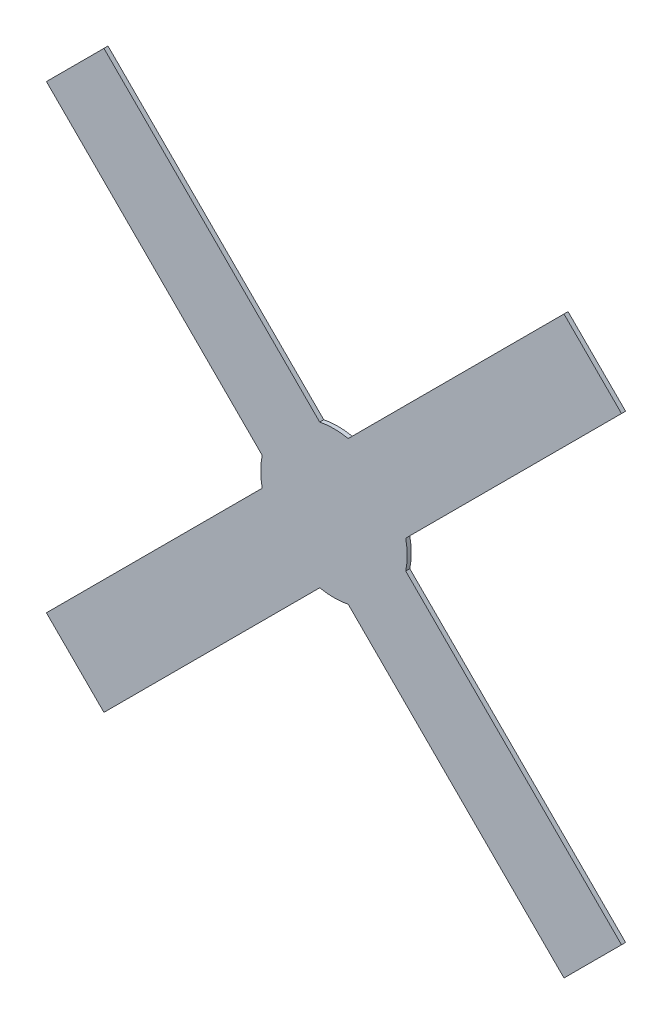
ISO-10303-21;
HEADER;
FILE_DESCRIPTION(('STEP AP214'),'2;1');
FILE_NAME('part.step','',(''),(''),'','','');
FILE_SCHEMA(('AUTOMOTIVE_DESIGN { 1 0 10303 214 1 1 1 1 }'));
ENDSEC;
DATA;
#1=APPLICATION_CONTEXT('core data for automotive mechanical design processes');
#2=APPLICATION_PROTOCOL_DEFINITION('international standard','automotive_design',2000,#1);
#3=PRODUCT_CONTEXT('',#1,'mechanical');
#4=PRODUCT('Part','Part','',(#3));
#5=PRODUCT_RELATED_PRODUCT_CATEGORY('part','',(#4));
#6=PRODUCT_DEFINITION_FORMATION('','',#4);
#7=PRODUCT_DEFINITION_CONTEXT('part definition',#1,'design');
#8=PRODUCT_DEFINITION('design','',#6,#7);
#9=PRODUCT_DEFINITION_SHAPE('','',#8);
#10=(LENGTH_UNIT() NAMED_UNIT(*) SI_UNIT(.MILLI.,.METRE.));
#11=(NAMED_UNIT(*) PLANE_ANGLE_UNIT() SI_UNIT($,.RADIAN.));
#12=(NAMED_UNIT(*) SI_UNIT($,.STERADIAN.) SOLID_ANGLE_UNIT());
#13=UNCERTAINTY_MEASURE_WITH_UNIT(LENGTH_MEASURE(1.E-05),#10,'distance_accuracy_value','');
#14=(GEOMETRIC_REPRESENTATION_CONTEXT(3) GLOBAL_UNCERTAINTY_ASSIGNED_CONTEXT((#13)) GLOBAL_UNIT_ASSIGNED_CONTEXT((#10,
#11,#12)) REPRESENTATION_CONTEXT('',''));
#15=CARTESIAN_POINT('',(0.,0.,0.));
#16=DIRECTION('',(0.,0.,1.));
#17=DIRECTION('',(1.,0.,0.));
#18=AXIS2_PLACEMENT_3D('',#15,#16,#17);
#19=CARTESIAN_POINT('',(0.,0.,5.));
#20=DIRECTION('',(0.,0.,-1.));
#21=DIRECTION('',(-1.,0.,0.));
#22=AXIS2_PLACEMENT_3D('',#19,#20,#21);
#23=CYLINDRICAL_SURFACE('',#22,90.0000000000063);
#24=CARTESIAN_POINT('',(0.,0.,0.));
#25=DIRECTION('',(0.,0.,1.));
#26=DIRECTION('',(1.,0.,0.));
#27=AXIS2_PLACEMENT_3D('',#24,#25,#26);
#28=CIRCLE('',#27,90.0000000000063);
#29=CARTESIAN_POINT('',(-88.2703652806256,17.5596871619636,0.));
#30=VERTEX_POINT('',#29);
#31=CARTESIAN_POINT('',(-88.2703652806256,-17.5596871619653,0.));
#32=VERTEX_POINT('',#31);
#33=EDGE_CURVE('E177',#30,#32,#28,.T.);
#34=ORIENTED_EDGE('',*,*,#33,.T.);
#35=DIRECTION('',(0.,0.,-1.));
#36=VECTOR('',#35,1.);
#37=CARTESIAN_POINT('',(-88.2703652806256,-17.5596871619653,5.));
#38=LINE('',#37,#36);
#39=CARTESIAN_POINT('',(-88.2703652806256,-17.5596871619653,5.));
#40=VERTEX_POINT('',#39);
#41=EDGE_CURVE('E11',#40,#32,#38,.T.);
#42=ORIENTED_EDGE('',*,*,#41,.F.);
#43=CARTESIAN_POINT('',(0.,0.,5.));
#44=DIRECTION('',(0.,0.,1.));
#45=DIRECTION('',(1.,0.,0.));
#46=AXIS2_PLACEMENT_3D('',#43,#44,#45);
#47=CIRCLE('',#46,90.0000000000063);
#48=CARTESIAN_POINT('',(-88.2703652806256,17.5596871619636,5.));
#49=VERTEX_POINT('',#48);
#50=EDGE_CURVE('E207',#49,#40,#47,.T.);
#51=ORIENTED_EDGE('',*,*,#50,.F.);
#52=DIRECTION('',(0.,0.,-1.));
#53=VECTOR('',#52,1.);
#54=CARTESIAN_POINT('',(-88.2703652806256,17.5596871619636,5.));
#55=LINE('',#54,#53);
#56=EDGE_CURVE('E173',#49,#30,#55,.T.);
#57=ORIENTED_EDGE('',*,*,#56,.T.);
#58=EDGE_LOOP('',(#34,#42,#51,#57));
#59=FACE_BOUND('',#58,.T.);
#60=ADVANCED_FACE('F33',(#59),#23,.T.);
#61=CARTESIAN_POINT('',(-353.55339059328,-282.84271247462,5.));
#62=DIRECTION('',(0.707106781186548,-0.707106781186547,0.));
#63=DIRECTION('',(0.707106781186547,0.707106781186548,0.));
#64=AXIS2_PLACEMENT_3D('',#61,#62,#63);
#65=PLANE('',#64);
#66=DIRECTION('',(-0.707106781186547,-0.707106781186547,0.));
#67=VECTOR('',#66,1.);
#68=CARTESIAN_POINT('',(-353.55339059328,-282.84271247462,0.));
#69=LINE('',#68,#67);
#70=CARTESIAN_POINT('',(-353.55339059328,-282.84271247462,0.));
#71=VERTEX_POINT('',#70);
#72=EDGE_CURVE('E180',#32,#71,#69,.T.);
#73=ORIENTED_EDGE('',*,*,#72,.T.);
#74=DIRECTION('',(0.,0.,-1.));
#75=VECTOR('',#74,1.);
#76=CARTESIAN_POINT('',(-353.55339059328,-282.84271247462,5.));
#77=LINE('',#76,#75);
#78=CARTESIAN_POINT('',(-353.55339059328,-282.84271247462,5.));
#79=VERTEX_POINT('',#78);
#80=EDGE_CURVE('E41',#79,#71,#77,.T.);
#81=ORIENTED_EDGE('',*,*,#80,.F.);
#82=DIRECTION('',(-0.707106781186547,-0.707106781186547,0.));
#83=VECTOR('',#82,1.);
#84=CARTESIAN_POINT('',(-353.55339059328,-282.84271247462,5.));
#85=LINE('',#84,#83);
#86=EDGE_CURVE('E116',#40,#79,#85,.T.);
#87=ORIENTED_EDGE('',*,*,#86,.F.);
#88=ORIENTED_EDGE('',*,*,#41,.T.);
#89=EDGE_LOOP('',(#73,#81,#87,#88));
#90=FACE_BOUND('',#89,.T.);
#91=ADVANCED_FACE('F305',(#90),#65,.F.);
#92=CARTESIAN_POINT('',(-282.842712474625,-353.553390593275,5.));
#93=DIRECTION('',(0.707106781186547,0.707106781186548,0.));
#94=DIRECTION('',(-0.707106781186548,0.707106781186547,0.));
#95=AXIS2_PLACEMENT_3D('',#92,#93,#94);
#96=PLANE('',#95);
#97=DIRECTION('',(0.707106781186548,-0.707106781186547,0.));
#98=VECTOR('',#97,1.);
#99=CARTESIAN_POINT('',(-282.842712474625,-353.553390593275,0.));
#100=LINE('',#99,#98);
#101=CARTESIAN_POINT('',(-282.842712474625,-353.553390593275,0.));
#102=VERTEX_POINT('',#101);
#103=EDGE_CURVE('E182',#71,#102,#100,.T.);
#104=ORIENTED_EDGE('',*,*,#103,.T.);
#105=DIRECTION('',(0.,0.,-1.));
#106=VECTOR('',#105,1.);
#107=CARTESIAN_POINT('',(-282.842712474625,-353.553390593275,5.));
#108=LINE('',#107,#106);
#109=CARTESIAN_POINT('',(-282.842712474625,-353.553390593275,5.));
#110=VERTEX_POINT('',#109);
#111=EDGE_CURVE('E238',#110,#102,#108,.T.);
#112=ORIENTED_EDGE('',*,*,#111,.F.);
#113=DIRECTION('',(0.707106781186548,-0.707106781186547,0.));
#114=VECTOR('',#113,1.);
#115=CARTESIAN_POINT('',(-282.842712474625,-353.553390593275,5.));
#116=LINE('',#115,#114);
#117=EDGE_CURVE('E246',#79,#110,#116,.T.);
#118=ORIENTED_EDGE('',*,*,#117,.F.);
#119=ORIENTED_EDGE('',*,*,#80,.T.);
#120=EDGE_LOOP('',(#104,#112,#118,#119));
#121=FACE_BOUND('',#120,.T.);
#122=ADVANCED_FACE('F244',(#121),#96,.F.);
#123=CARTESIAN_POINT('',(-17.5596871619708,-88.27036528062,5.));
#124=DIRECTION('',(-0.707106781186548,0.707106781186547,0.));
#125=DIRECTION('',(-0.707106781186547,-0.707106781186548,0.));
#126=AXIS2_PLACEMENT_3D('',#123,#124,#125);
#127=PLANE('',#126);
#128=DIRECTION('',(0.707106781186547,0.707106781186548,0.));
#129=VECTOR('',#128,1.);
#130=CARTESIAN_POINT('',(-17.5596871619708,-88.27036528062,0.));
#131=LINE('',#130,#129);
#132=CARTESIAN_POINT('',(-17.5596871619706,-88.2703652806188,0.));
#133=VERTEX_POINT('',#132);
#134=EDGE_CURVE('E184',#102,#133,#131,.T.);
#135=ORIENTED_EDGE('',*,*,#134,.T.);
#136=DIRECTION('',(0.,0.,-1.));
#137=VECTOR('',#136,1.);
#138=CARTESIAN_POINT('',(-17.5596871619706,-88.2703652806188,5.));
#139=LINE('',#138,#137);
#140=CARTESIAN_POINT('',(-17.5596871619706,-88.2703652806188,5.));
#141=VERTEX_POINT('',#140);
#142=EDGE_CURVE('E235',#141,#133,#139,.T.);
#143=ORIENTED_EDGE('',*,*,#142,.F.);
#144=DIRECTION('',(0.707106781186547,0.707106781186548,0.));
#145=VECTOR('',#144,1.);
#146=CARTESIAN_POINT('',(-17.5596871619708,-88.27036528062,5.));
#147=LINE('',#146,#145);
#148=EDGE_CURVE('E264',#110,#141,#147,.T.);
#149=ORIENTED_EDGE('',*,*,#148,.F.);
#150=ORIENTED_EDGE('',*,*,#111,.T.);
#151=EDGE_LOOP('',(#135,#143,#149,#150));
#152=FACE_BOUND('',#151,.T.);
#153=ADVANCED_FACE('F255',(#152),#127,.F.);
#154=CARTESIAN_POINT('',(0.,0.,5.));
#155=DIRECTION('',(0.,0.,-1.));
#156=DIRECTION('',(-1.,0.,0.));
#157=AXIS2_PLACEMENT_3D('',#154,#155,#156);
#158=CYLINDRICAL_SURFACE('',#157,90.0000000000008);
#159=CARTESIAN_POINT('',(0.,0.,0.));
#160=DIRECTION('',(0.,0.,1.));
#161=DIRECTION('',(1.,0.,0.));
#162=AXIS2_PLACEMENT_3D('',#159,#160,#161);
#163=CIRCLE('',#162,90.0000000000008);
#164=CARTESIAN_POINT('',(17.559687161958,-88.27036528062,0.));
#165=VERTEX_POINT('',#164);
#166=EDGE_CURVE('E186',#133,#165,#163,.T.);
#167=ORIENTED_EDGE('',*,*,#166,.T.);
#168=DIRECTION('',(0.,0.,-1.));
#169=VECTOR('',#168,1.);
#170=CARTESIAN_POINT('',(17.559687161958,-88.27036528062,5.));
#171=LINE('',#170,#169);
#172=CARTESIAN_POINT('',(17.559687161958,-88.27036528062,5.));
#173=VERTEX_POINT('',#172);
#174=EDGE_CURVE('E232',#173,#165,#171,.T.);
#175=ORIENTED_EDGE('',*,*,#174,.F.);
#176=CARTESIAN_POINT('',(0.,0.,5.));
#177=DIRECTION('',(0.,0.,1.));
#178=DIRECTION('',(1.,0.,0.));
#179=AXIS2_PLACEMENT_3D('',#176,#177,#178);
#180=CIRCLE('',#179,90.0000000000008);
#181=EDGE_CURVE('E261',#141,#173,#180,.T.);
#182=ORIENTED_EDGE('',*,*,#181,.F.);
#183=ORIENTED_EDGE('',*,*,#142,.T.);
#184=EDGE_LOOP('',(#167,#175,#182,#183));
#185=FACE_BOUND('',#184,.T.);
#186=ADVANCED_FACE('F259',(#185),#158,.T.);
#187=CARTESIAN_POINT('',(282.842712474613,-353.553390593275,5.));
#188=DIRECTION('',(0.707106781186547,0.707106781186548,0.));
#189=DIRECTION('',(-0.707106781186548,0.707106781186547,0.));
#190=AXIS2_PLACEMENT_3D('',#187,#188,#189);
#191=PLANE('',#190);
#192=DIRECTION('',(0.707106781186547,-0.707106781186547,0.));
#193=VECTOR('',#192,1.);
#194=CARTESIAN_POINT('',(282.842712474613,-353.553390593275,0.));
#195=LINE('',#194,#193);
#196=CARTESIAN_POINT('',(282.842712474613,-353.553390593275,0.));
#197=VERTEX_POINT('',#196);
#198=EDGE_CURVE('E188',#165,#197,#195,.T.);
#199=ORIENTED_EDGE('',*,*,#198,.T.);
#200=DIRECTION('',(0.,0.,-1.));
#201=VECTOR('',#200,1.);
#202=CARTESIAN_POINT('',(282.842712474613,-353.553390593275,5.));
#203=LINE('',#202,#201);
#204=CARTESIAN_POINT('',(282.842712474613,-353.553390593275,5.));
#205=VERTEX_POINT('',#204);
#206=EDGE_CURVE('E229',#205,#197,#203,.T.);
#207=ORIENTED_EDGE('',*,*,#206,.F.);
#208=DIRECTION('',(0.707106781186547,-0.707106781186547,0.));
#209=VECTOR('',#208,1.);
#210=CARTESIAN_POINT('',(282.842712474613,-353.553390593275,5.));
#211=LINE('',#210,#209);
#212=EDGE_CURVE('E263',#173,#205,#211,.T.);
#213=ORIENTED_EDGE('',*,*,#212,.F.);
#214=ORIENTED_EDGE('',*,*,#174,.T.);
#215=EDGE_LOOP('',(#199,#207,#213,#214));
#216=FACE_BOUND('',#215,.T.);
#217=ADVANCED_FACE('F318',(#216),#191,.F.);
#218=CARTESIAN_POINT('',(353.553390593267,-282.84271247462,5.));
#219=DIRECTION('',(-0.707106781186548,0.707106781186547,0.));
#220=DIRECTION('',(-0.707106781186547,-0.707106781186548,0.));
#221=AXIS2_PLACEMENT_3D('',#218,#219,#220);
#222=PLANE('',#221);
#223=DIRECTION('',(0.707106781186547,0.707106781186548,0.));
#224=VECTOR('',#223,1.);
#225=CARTESIAN_POINT('',(353.553390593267,-282.84271247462,0.));
#226=LINE('',#225,#224);
#227=CARTESIAN_POINT('',(353.553390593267,-282.84271247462,0.));
#228=VERTEX_POINT('',#227);
#229=EDGE_CURVE('E190',#197,#228,#226,.T.);
#230=ORIENTED_EDGE('',*,*,#229,.T.);
#231=DIRECTION('',(0.,0.,-1.));
#232=VECTOR('',#231,1.);
#233=CARTESIAN_POINT('',(353.553390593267,-282.84271247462,5.));
#234=LINE('',#233,#232);
#235=CARTESIAN_POINT('',(353.553390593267,-282.84271247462,5.));
#236=VERTEX_POINT('',#235);
#237=EDGE_CURVE('E226',#236,#228,#234,.T.);
#238=ORIENTED_EDGE('',*,*,#237,.F.);
#239=DIRECTION('',(0.707106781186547,0.707106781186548,0.));
#240=VECTOR('',#239,1.);
#241=CARTESIAN_POINT('',(353.553390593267,-282.84271247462,5.));
#242=LINE('',#241,#240);
#243=EDGE_CURVE('E266',#205,#236,#242,.T.);
#244=ORIENTED_EDGE('',*,*,#243,.F.);
#245=ORIENTED_EDGE('',*,*,#206,.T.);
#246=EDGE_LOOP('',(#230,#238,#244,#245));
#247=FACE_BOUND('',#246,.T.);
#248=ADVANCED_FACE('F321',(#247),#222,.F.);
#249=CARTESIAN_POINT('',(88.2703652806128,-17.5596871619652,5.));
#250=DIRECTION('',(-0.707106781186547,-0.707106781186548,0.));
#251=DIRECTION('',(0.707106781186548,-0.707106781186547,0.));
#252=AXIS2_PLACEMENT_3D('',#249,#250,#251);
#253=PLANE('',#252);
#254=DIRECTION('',(-0.707106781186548,0.707106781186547,0.));
#255=VECTOR('',#254,1.);
#256=CARTESIAN_POINT('',(88.2703652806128,-17.5596871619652,0.));
#257=LINE('',#256,#255);
#258=CARTESIAN_POINT('',(88.2703652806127,-17.5596871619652,0.));
#259=VERTEX_POINT('',#258);
#260=EDGE_CURVE('E192',#228,#259,#257,.T.);
#261=ORIENTED_EDGE('',*,*,#260,.T.);
#262=DIRECTION('',(0.,0.,-1.));
#263=VECTOR('',#262,1.);
#264=CARTESIAN_POINT('',(88.2703652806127,-17.5596871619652,5.));
#265=LINE('',#264,#263);
#266=CARTESIAN_POINT('',(88.2703652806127,-17.5596871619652,5.));
#267=VERTEX_POINT('',#266);
#268=EDGE_CURVE('E223',#267,#259,#265,.T.);
#269=ORIENTED_EDGE('',*,*,#268,.F.);
#270=DIRECTION('',(-0.707106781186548,0.707106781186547,0.));
#271=VECTOR('',#270,1.);
#272=CARTESIAN_POINT('',(88.2703652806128,-17.5596871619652,5.));
#273=LINE('',#272,#271);
#274=EDGE_CURVE('E272',#236,#267,#273,.T.);
#275=ORIENTED_EDGE('',*,*,#274,.F.);
#276=ORIENTED_EDGE('',*,*,#237,.T.);
#277=EDGE_LOOP('',(#261,#269,#275,#276));
#278=FACE_BOUND('',#277,.T.);
#279=ADVANCED_FACE('F325',(#278),#253,.F.);
#280=CARTESIAN_POINT('',(0.,0.,5.));
#281=DIRECTION('',(0.,0.,-1.));
#282=DIRECTION('',(-1.,0.,0.));
#283=AXIS2_PLACEMENT_3D('',#280,#281,#282);
#284=CYLINDRICAL_SURFACE('',#283,89.9999999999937);
#285=CARTESIAN_POINT('',(0.,0.,0.));
#286=DIRECTION('',(0.,0.,1.));
#287=DIRECTION('',(1.,0.,0.));
#288=AXIS2_PLACEMENT_3D('',#285,#286,#287);
#289=CIRCLE('',#288,89.9999999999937);
#290=CARTESIAN_POINT('',(88.2703652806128,17.5596871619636,0.));
#291=VERTEX_POINT('',#290);
#292=EDGE_CURVE('E194',#259,#291,#289,.T.);
#293=ORIENTED_EDGE('',*,*,#292,.T.);
#294=DIRECTION('',(0.,0.,-1.));
#295=VECTOR('',#294,1.);
#296=CARTESIAN_POINT('',(88.2703652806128,17.5596871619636,5.));
#297=LINE('',#296,#295);
#298=CARTESIAN_POINT('',(88.2703652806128,17.5596871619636,5.));
#299=VERTEX_POINT('',#298);
#300=EDGE_CURVE('E220',#299,#291,#297,.T.);
#301=ORIENTED_EDGE('',*,*,#300,.F.);
#302=CARTESIAN_POINT('',(0.,0.,5.));
#303=DIRECTION('',(0.,0.,1.));
#304=DIRECTION('',(1.,0.,0.));
#305=AXIS2_PLACEMENT_3D('',#302,#303,#304);
#306=CIRCLE('',#305,89.9999999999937);
#307=EDGE_CURVE('E274',#267,#299,#306,.T.);
#308=ORIENTED_EDGE('',*,*,#307,.F.);
#309=ORIENTED_EDGE('',*,*,#268,.T.);
#310=EDGE_LOOP('',(#293,#301,#308,#309));
#311=FACE_BOUND('',#310,.T.);
#312=ADVANCED_FACE('F329',(#311),#284,.T.);
#313=CARTESIAN_POINT('',(353.553390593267,282.842712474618,5.));
#314=DIRECTION('',(-0.707106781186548,0.707106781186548,0.));
#315=DIRECTION('',(-0.707106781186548,-0.707106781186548,0.));
#316=AXIS2_PLACEMENT_3D('',#313,#314,#315);
#317=PLANE('',#316);
#318=DIRECTION('',(0.707106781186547,0.707106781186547,0.));
#319=VECTOR('',#318,1.);
#320=CARTESIAN_POINT('',(353.553390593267,282.842712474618,0.));
#321=LINE('',#320,#319);
#322=CARTESIAN_POINT('',(353.553390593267,282.842712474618,0.));
#323=VERTEX_POINT('',#322);
#324=EDGE_CURVE('E196',#291,#323,#321,.T.);
#325=ORIENTED_EDGE('',*,*,#324,.T.);
#326=DIRECTION('',(0.,0.,-1.));
#327=VECTOR('',#326,1.);
#328=CARTESIAN_POINT('',(353.553390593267,282.842712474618,5.));
#329=LINE('',#328,#327);
#330=CARTESIAN_POINT('',(353.553390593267,282.842712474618,5.));
#331=VERTEX_POINT('',#330);
#332=EDGE_CURVE('E217',#331,#323,#329,.T.);
#333=ORIENTED_EDGE('',*,*,#332,.F.);
#334=DIRECTION('',(0.707106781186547,0.707106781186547,0.));
#335=VECTOR('',#334,1.);
#336=CARTESIAN_POINT('',(353.553390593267,282.842712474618,5.));
#337=LINE('',#336,#335);
#338=EDGE_CURVE('E276',#299,#331,#337,.T.);
#339=ORIENTED_EDGE('',*,*,#338,.F.);
#340=ORIENTED_EDGE('',*,*,#300,.T.);
#341=EDGE_LOOP('',(#325,#333,#339,#340));
#342=FACE_BOUND('',#341,.T.);
#343=ADVANCED_FACE('F333',(#342),#317,.F.);
#344=CARTESIAN_POINT('',(282.842712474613,353.553390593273,5.));
#345=DIRECTION('',(-0.707106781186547,-0.707106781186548,0.));
#346=DIRECTION('',(0.707106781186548,-0.707106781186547,0.));
#347=AXIS2_PLACEMENT_3D('',#344,#345,#346);
#348=PLANE('',#347);
#349=DIRECTION('',(-0.707106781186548,0.707106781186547,0.));
#350=VECTOR('',#349,1.);
#351=CARTESIAN_POINT('',(282.842712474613,353.553390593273,0.));
#352=LINE('',#351,#350);
#353=CARTESIAN_POINT('',(282.842712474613,353.553390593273,0.));
#354=VERTEX_POINT('',#353);
#355=EDGE_CURVE('E198',#323,#354,#352,.T.);
#356=ORIENTED_EDGE('',*,*,#355,.T.);
#357=DIRECTION('',(0.,0.,-1.));
#358=VECTOR('',#357,1.);
#359=CARTESIAN_POINT('',(282.842712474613,353.553390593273,5.));
#360=LINE('',#359,#358);
#361=CARTESIAN_POINT('',(282.842712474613,353.553390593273,5.));
#362=VERTEX_POINT('',#361);
#363=EDGE_CURVE('E214',#362,#354,#360,.T.);
#364=ORIENTED_EDGE('',*,*,#363,.F.);
#365=DIRECTION('',(-0.707106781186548,0.707106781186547,0.));
#366=VECTOR('',#365,1.);
#367=CARTESIAN_POINT('',(282.842712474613,353.553390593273,5.));
#368=LINE('',#367,#366);
#369=EDGE_CURVE('E278',#331,#362,#368,.T.);
#370=ORIENTED_EDGE('',*,*,#369,.F.);
#371=ORIENTED_EDGE('',*,*,#332,.T.);
#372=EDGE_LOOP('',(#356,#364,#370,#371));
#373=FACE_BOUND('',#372,.T.);
#374=ADVANCED_FACE('F337',(#373),#348,.F.);
#375=CARTESIAN_POINT('',(17.559687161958,88.2703652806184,5.));
#376=DIRECTION('',(0.707106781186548,-0.707106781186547,0.));
#377=DIRECTION('',(0.707106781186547,0.707106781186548,0.));
#378=AXIS2_PLACEMENT_3D('',#375,#376,#377);
#379=PLANE('',#378);
#380=DIRECTION('',(-0.707106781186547,-0.707106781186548,0.));
#381=VECTOR('',#380,1.);
#382=CARTESIAN_POINT('',(17.559687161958,88.2703652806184,0.));
#383=LINE('',#382,#381);
#384=CARTESIAN_POINT('',(17.5596871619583,88.2703652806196,0.));
#385=VERTEX_POINT('',#384);
#386=EDGE_CURVE('E200',#354,#385,#383,.T.);
#387=ORIENTED_EDGE('',*,*,#386,.T.);
#388=DIRECTION('',(0.,0.,-1.));
#389=VECTOR('',#388,1.);
#390=CARTESIAN_POINT('',(17.5596871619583,88.2703652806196,5.));
#391=LINE('',#390,#389);
#392=CARTESIAN_POINT('',(17.5596871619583,88.2703652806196,5.));
#393=VERTEX_POINT('',#392);
#394=EDGE_CURVE('E211',#393,#385,#391,.T.);
#395=ORIENTED_EDGE('',*,*,#394,.F.);
#396=DIRECTION('',(-0.707106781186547,-0.707106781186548,0.));
#397=VECTOR('',#396,1.);
#398=CARTESIAN_POINT('',(17.559687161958,88.2703652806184,5.));
#399=LINE('',#398,#397);
#400=EDGE_CURVE('E280',#362,#393,#399,.T.);
#401=ORIENTED_EDGE('',*,*,#400,.F.);
#402=ORIENTED_EDGE('',*,*,#363,.T.);
#403=EDGE_LOOP('',(#387,#395,#401,#402));
#404=FACE_BOUND('',#403,.T.);
#405=ADVANCED_FACE('F286',(#404),#379,.F.);
#406=CARTESIAN_POINT('',(0.,0.,5.));
#407=DIRECTION('',(0.,0.,-1.));
#408=DIRECTION('',(-1.,0.,0.));
#409=AXIS2_PLACEMENT_3D('',#406,#407,#408);
#410=CYLINDRICAL_SURFACE('',#409,89.9999999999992);
#411=CARTESIAN_POINT('',(0.,0.,0.));
#412=DIRECTION('',(0.,0.,1.));
#413=DIRECTION('',(1.,0.,0.));
#414=AXIS2_PLACEMENT_3D('',#411,#412,#413);
#415=CIRCLE('',#414,89.9999999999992);
#416=CARTESIAN_POINT('',(-17.5596871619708,88.2703652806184,0.));
#417=VERTEX_POINT('',#416);
#418=EDGE_CURVE('E202',#385,#417,#415,.T.);
#419=ORIENTED_EDGE('',*,*,#418,.T.);
#420=DIRECTION('',(0.,0.,-1.));
#421=VECTOR('',#420,1.);
#422=CARTESIAN_POINT('',(-17.5596871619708,88.2703652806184,5.));
#423=LINE('',#422,#421);
#424=CARTESIAN_POINT('',(-17.5596871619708,88.2703652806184,5.));
#425=VERTEX_POINT('',#424);
#426=EDGE_CURVE('E168',#425,#417,#423,.T.);
#427=ORIENTED_EDGE('',*,*,#426,.F.);
#428=CARTESIAN_POINT('',(0.,0.,5.));
#429=DIRECTION('',(0.,0.,1.));
#430=DIRECTION('',(1.,0.,0.));
#431=AXIS2_PLACEMENT_3D('',#428,#429,#430);
#432=CIRCLE('',#431,89.9999999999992);
#433=EDGE_CURVE('E159',#393,#425,#432,.T.);
#434=ORIENTED_EDGE('',*,*,#433,.F.);
#435=ORIENTED_EDGE('',*,*,#394,.T.);
#436=EDGE_LOOP('',(#419,#427,#434,#435));
#437=FACE_BOUND('',#436,.T.);
#438=ADVANCED_FACE('F290',(#437),#410,.T.);
#439=CARTESIAN_POINT('',(-282.842712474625,353.553390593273,5.));
#440=DIRECTION('',(-0.707106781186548,-0.707106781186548,0.));
#441=DIRECTION('',(0.707106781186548,-0.707106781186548,0.));
#442=AXIS2_PLACEMENT_3D('',#439,#440,#441);
#443=PLANE('',#442);
#444=DIRECTION('',(-0.707106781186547,0.707106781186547,0.));
#445=VECTOR('',#444,1.);
#446=CARTESIAN_POINT('',(-282.842712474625,353.553390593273,0.));
#447=LINE('',#446,#445);
#448=CARTESIAN_POINT('',(-282.842712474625,353.553390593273,0.));
#449=VERTEX_POINT('',#448);
#450=EDGE_CURVE('E167',#417,#449,#447,.T.);
#451=ORIENTED_EDGE('',*,*,#450,.T.);
#452=DIRECTION('',(0.,0.,-1.));
#453=VECTOR('',#452,1.);
#454=CARTESIAN_POINT('',(-282.842712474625,353.553390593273,5.));
#455=LINE('',#454,#453);
#456=CARTESIAN_POINT('',(-282.842712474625,353.553390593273,5.));
#457=VERTEX_POINT('',#456);
#458=EDGE_CURVE('E164',#457,#449,#455,.T.);
#459=ORIENTED_EDGE('',*,*,#458,.F.);
#460=DIRECTION('',(-0.707106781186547,0.707106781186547,0.));
#461=VECTOR('',#460,1.);
#462=CARTESIAN_POINT('',(-282.842712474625,353.553390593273,5.));
#463=LINE('',#462,#461);
#464=EDGE_CURVE('E153',#425,#457,#463,.T.);
#465=ORIENTED_EDGE('',*,*,#464,.F.);
#466=ORIENTED_EDGE('',*,*,#426,.T.);
#467=EDGE_LOOP('',(#451,#459,#465,#466));
#468=FACE_BOUND('',#467,.T.);
#469=ADVANCED_FACE('F165',(#468),#443,.F.);
#470=CARTESIAN_POINT('',(-353.55339059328,282.842712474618,5.));
#471=DIRECTION('',(0.707106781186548,-0.707106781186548,0.));
#472=DIRECTION('',(0.707106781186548,0.707106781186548,0.));
#473=AXIS2_PLACEMENT_3D('',#470,#471,#472);
#474=PLANE('',#473);
#475=DIRECTION('',(-0.707106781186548,-0.707106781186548,0.));
#476=VECTOR('',#475,1.);
#477=CARTESIAN_POINT('',(-353.55339059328,282.842712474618,0.));
#478=LINE('',#477,#476);
#479=CARTESIAN_POINT('',(-353.55339059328,282.842712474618,0.));
#480=VERTEX_POINT('',#479);
#481=EDGE_CURVE('E102',#449,#480,#478,.T.);
#482=ORIENTED_EDGE('',*,*,#481,.T.);
#483=DIRECTION('',(0.,0.,-1.));
#484=VECTOR('',#483,1.);
#485=CARTESIAN_POINT('',(-353.55339059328,282.842712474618,5.));
#486=LINE('',#485,#484);
#487=CARTESIAN_POINT('',(-353.55339059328,282.842712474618,5.));
#488=VERTEX_POINT('',#487);
#489=EDGE_CURVE('E169',#488,#480,#486,.T.);
#490=ORIENTED_EDGE('',*,*,#489,.F.);
#491=DIRECTION('',(-0.707106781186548,-0.707106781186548,0.));
#492=VECTOR('',#491,1.);
#493=CARTESIAN_POINT('',(-353.55339059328,282.842712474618,5.));
#494=LINE('',#493,#492);
#495=EDGE_CURVE('E157',#457,#488,#494,.T.);
#496=ORIENTED_EDGE('',*,*,#495,.F.);
#497=ORIENTED_EDGE('',*,*,#458,.T.);
#498=EDGE_LOOP('',(#482,#490,#496,#497));
#499=FACE_BOUND('',#498,.T.);
#500=ADVANCED_FACE('F171',(#499),#474,.F.);
#501=CARTESIAN_POINT('',(-88.2703652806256,17.5596871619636,5.));
#502=DIRECTION('',(0.707106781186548,0.707106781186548,0.));
#503=DIRECTION('',(-0.707106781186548,0.707106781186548,0.));
#504=AXIS2_PLACEMENT_3D('',#501,#502,#503);
#505=PLANE('',#504);
#506=DIRECTION('',(0.707106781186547,-0.707106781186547,0.));
#507=VECTOR('',#506,1.);
#508=CARTESIAN_POINT('',(-88.2703652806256,17.5596871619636,0.));
#509=LINE('',#508,#507);
#510=EDGE_CURVE('E108',#480,#30,#509,.T.);
#511=ORIENTED_EDGE('',*,*,#510,.T.);
#512=ORIENTED_EDGE('',*,*,#56,.F.);
#513=DIRECTION('',(0.707106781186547,-0.707106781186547,0.));
#514=VECTOR('',#513,1.);
#515=CARTESIAN_POINT('',(-88.2703652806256,17.5596871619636,5.));
#516=LINE('',#515,#514);
#517=EDGE_CURVE('E49',#488,#49,#516,.T.);
#518=ORIENTED_EDGE('',*,*,#517,.F.);
#519=ORIENTED_EDGE('',*,*,#489,.T.);
#520=EDGE_LOOP('',(#511,#512,#518,#519));
#521=FACE_BOUND('',#520,.T.);
#522=ADVANCED_FACE('F294',(#521),#505,.F.);
#523=CARTESIAN_POINT('',(0.,0.,5.));
#524=DIRECTION('',(0.,0.,1.));
#525=DIRECTION('',(1.,0.,0.));
#526=AXIS2_PLACEMENT_3D('',#523,#524,#525);
#527=PLANE('',#526);
#528=ORIENTED_EDGE('',*,*,#50,.T.);
#529=ORIENTED_EDGE('',*,*,#86,.T.);
#530=ORIENTED_EDGE('',*,*,#117,.T.);
#531=ORIENTED_EDGE('',*,*,#148,.T.);
#532=ORIENTED_EDGE('',*,*,#181,.T.);
#533=ORIENTED_EDGE('',*,*,#212,.T.);
#534=ORIENTED_EDGE('',*,*,#243,.T.);
#535=ORIENTED_EDGE('',*,*,#274,.T.);
#536=ORIENTED_EDGE('',*,*,#307,.T.);
#537=ORIENTED_EDGE('',*,*,#338,.T.);
#538=ORIENTED_EDGE('',*,*,#369,.T.);
#539=ORIENTED_EDGE('',*,*,#400,.T.);
#540=ORIENTED_EDGE('',*,*,#433,.T.);
#541=ORIENTED_EDGE('',*,*,#464,.T.);
#542=ORIENTED_EDGE('',*,*,#495,.T.);
#543=ORIENTED_EDGE('',*,*,#517,.T.);
#544=EDGE_LOOP('',(#528,#529,#530,#531,#532,#533,#534,#535,#536,#537,#538,#539,#540,#541,#542,#543));
#545=FACE_BOUND('',#544,.T.);
#546=ADVANCED_FACE('F155',(#545),#527,.T.);
#547=CARTESIAN_POINT('',(0.,0.,0.));
#548=DIRECTION('',(0.,0.,1.));
#549=DIRECTION('',(1.,0.,0.));
#550=AXIS2_PLACEMENT_3D('',#547,#548,#549);
#551=PLANE('',#550);
#552=ORIENTED_EDGE('',*,*,#33,.F.);
#553=ORIENTED_EDGE('',*,*,#510,.F.);
#554=ORIENTED_EDGE('',*,*,#481,.F.);
#555=ORIENTED_EDGE('',*,*,#450,.F.);
#556=ORIENTED_EDGE('',*,*,#418,.F.);
#557=ORIENTED_EDGE('',*,*,#386,.F.);
#558=ORIENTED_EDGE('',*,*,#355,.F.);
#559=ORIENTED_EDGE('',*,*,#324,.F.);
#560=ORIENTED_EDGE('',*,*,#292,.F.);
#561=ORIENTED_EDGE('',*,*,#260,.F.);
#562=ORIENTED_EDGE('',*,*,#229,.F.);
#563=ORIENTED_EDGE('',*,*,#198,.F.);
#564=ORIENTED_EDGE('',*,*,#166,.F.);
#565=ORIENTED_EDGE('',*,*,#134,.F.);
#566=ORIENTED_EDGE('',*,*,#103,.F.);
#567=ORIENTED_EDGE('',*,*,#72,.F.);
#568=EDGE_LOOP('',(#552,#553,#554,#555,#556,#557,#558,#559,#560,#561,#562,#563,#564,#565,#566,#567));
#569=FACE_BOUND('',#568,.T.);
#570=ADVANCED_FACE('F250',(#569),#551,.F.);
#571=CLOSED_SHELL('',(#60,#91,#122,#153,#186,#217,#248,#279,#312,#343,#374,#405,#438,#469,#500,
#522,#546,#570));
#572=MANIFOLD_SOLID_BREP('B2',#571);
#573=ADVANCED_BREP_SHAPE_REPRESENTATION('',(#18,#572),#14);
#574=SHAPE_DEFINITION_REPRESENTATION(#9,#573);
ENDSEC;
END-ISO-10303-21;
